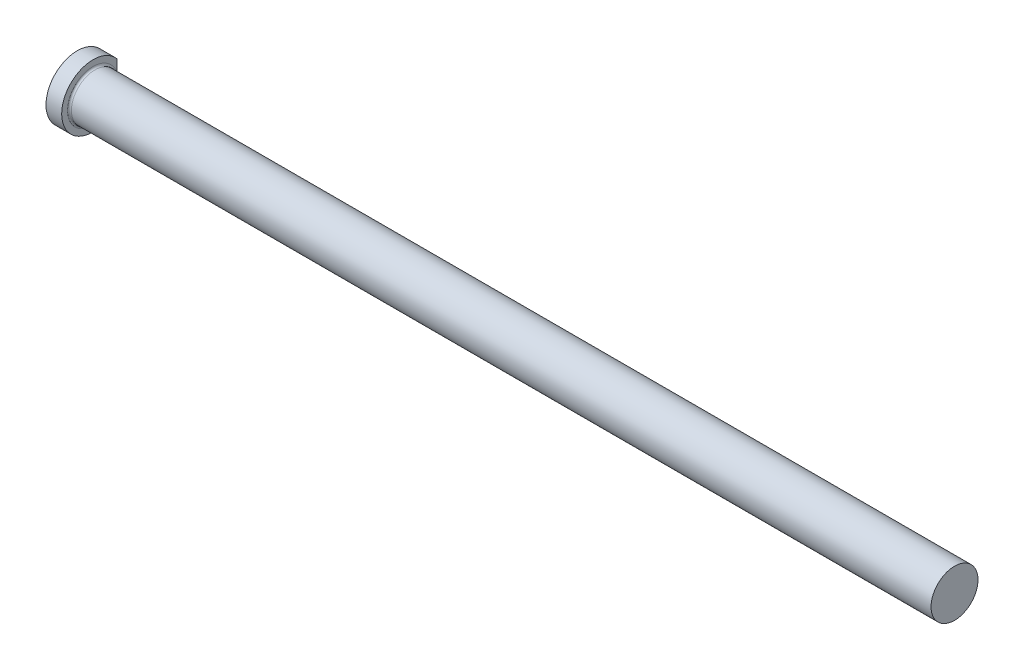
ISO-10303-21;
HEADER;
FILE_DESCRIPTION(('STEP AP214'),'2;1');
FILE_NAME('part.step','',(''),(''),'','','');
FILE_SCHEMA(('AUTOMOTIVE_DESIGN { 1 0 10303 214 1 1 1 1 }'));
ENDSEC;
DATA;
#1=APPLICATION_CONTEXT('core data for automotive mechanical design processes');
#2=APPLICATION_PROTOCOL_DEFINITION('international standard','automotive_design',2000,#1);
#3=PRODUCT_CONTEXT('',#1,'mechanical');
#4=PRODUCT('Part','Part','',(#3));
#5=PRODUCT_RELATED_PRODUCT_CATEGORY('part','',(#4));
#6=PRODUCT_DEFINITION_FORMATION('','',#4);
#7=PRODUCT_DEFINITION_CONTEXT('part definition',#1,'design');
#8=PRODUCT_DEFINITION('design','',#6,#7);
#9=PRODUCT_DEFINITION_SHAPE('','',#8);
#10=(LENGTH_UNIT() NAMED_UNIT(*) SI_UNIT(.MILLI.,.METRE.));
#11=(NAMED_UNIT(*) PLANE_ANGLE_UNIT() SI_UNIT($,.RADIAN.));
#12=(NAMED_UNIT(*) SI_UNIT($,.STERADIAN.) SOLID_ANGLE_UNIT());
#13=UNCERTAINTY_MEASURE_WITH_UNIT(LENGTH_MEASURE(1.E-05),#10,'distance_accuracy_value','');
#14=(GEOMETRIC_REPRESENTATION_CONTEXT(3) GLOBAL_UNCERTAINTY_ASSIGNED_CONTEXT((#13)) GLOBAL_UNIT_ASSIGNED_CONTEXT((#10,
#11,#12)) REPRESENTATION_CONTEXT('',''));
#15=CARTESIAN_POINT('',(0.,0.,0.));
#16=DIRECTION('',(0.,0.,1.));
#17=DIRECTION('',(1.,0.,0.));
#18=AXIS2_PLACEMENT_3D('',#15,#16,#17);
#19=CARTESIAN_POINT('',(0.,0.,0.));
#20=DIRECTION('',(1.,0.,0.));
#21=DIRECTION('',(0.,1.,0.));
#22=AXIS2_PLACEMENT_3D('',#19,#20,#21);
#23=PLANE('',#22);
#24=DIRECTION('',(0.,1.,0.));
#25=VECTOR('',#24,1.);
#26=CARTESIAN_POINT('',(0.,0.,-9.69644999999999));
#27=LINE('',#26,#25);
#28=CARTESIAN_POINT('',(0.,-8.20175940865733,-9.69644999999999));
#29=VERTEX_POINT('',#28);
#30=CARTESIAN_POINT('',(0.,8.20175940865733,-9.69644999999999));
#31=VERTEX_POINT('',#30);
#32=EDGE_CURVE('E49',#29,#31,#27,.T.);
#33=ORIENTED_EDGE('',*,*,#32,.F.);
#34=CARTESIAN_POINT('',(0.,0.,0.));
#35=DIRECTION('',(-1.,0.,0.));
#36=DIRECTION('',(0.,-1.,0.));
#37=AXIS2_PLACEMENT_3D('',#34,#35,#36);
#38=CIRCLE('',#37,12.7);
#39=EDGE_CURVE('E43',#29,#31,#38,.T.);
#40=ORIENTED_EDGE('',*,*,#39,.T.);
#41=EDGE_LOOP('',(#33,#40));
#42=FACE_BOUND('',#41,.T.);
#43=ADVANCED_FACE('F32',(#42),#23,.F.);
#44=CARTESIAN_POINT('',(355.6,0.,0.));
#45=DIRECTION('',(-1.,0.,0.));
#46=DIRECTION('',(0.,-1.,0.));
#47=AXIS2_PLACEMENT_3D('',#44,#45,#46);
#48=CYLINDRICAL_SURFACE('',#47,12.7);
#49=DIRECTION('',(-1.,0.,0.));
#50=VECTOR('',#49,1.);
#51=CARTESIAN_POINT('',(355.6,-8.20175940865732,-9.69645));
#52=LINE('',#51,#50);
#53=CARTESIAN_POINT('',(6.35000000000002,-8.20175940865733,-9.69645));
#54=VERTEX_POINT('',#53);
#55=EDGE_CURVE('E87',#54,#29,#52,.T.);
#56=ORIENTED_EDGE('',*,*,#55,.F.);
#57=CARTESIAN_POINT('',(6.35000000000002,0.,0.));
#58=DIRECTION('',(-1.,0.,0.));
#59=DIRECTION('',(0.,-1.,0.));
#60=AXIS2_PLACEMENT_3D('',#57,#58,#59);
#61=CIRCLE('',#60,12.7);
#62=CARTESIAN_POINT('',(6.35000000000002,8.20175940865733,-9.69644999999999));
#63=VERTEX_POINT('',#62);
#64=EDGE_CURVE('E75',#54,#63,#61,.T.);
#65=ORIENTED_EDGE('',*,*,#64,.T.);
#66=DIRECTION('',(-1.,0.,0.));
#67=VECTOR('',#66,1.);
#68=CARTESIAN_POINT('',(355.6,8.20175940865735,-9.69644999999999));
#69=LINE('',#68,#67);
#70=EDGE_CURVE('E56',#31,#63,#69,.F.);
#71=ORIENTED_EDGE('',*,*,#70,.F.);
#72=ORIENTED_EDGE('',*,*,#39,.F.);
#73=EDGE_LOOP('',(#56,#65,#71,#72));
#74=FACE_BOUND('',#73,.T.);
#75=ADVANCED_FACE('F97',(#74),#48,.T.);
#76=CARTESIAN_POINT('',(6.35,12.7,0.));
#77=DIRECTION('',(-1.,0.,0.));
#78=DIRECTION('',(0.,-1.,0.));
#79=AXIS2_PLACEMENT_3D('',#76,#77,#78);
#80=PLANE('',#79);
#81=DIRECTION('',(0.,-1.,0.));
#82=VECTOR('',#81,1.);
#83=CARTESIAN_POINT('',(6.35,12.7,-9.69644999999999));
#84=LINE('',#83,#82);
#85=CARTESIAN_POINT('',(6.35000000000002,3.49192267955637,-9.69644999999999));
#86=VERTEX_POINT('',#85);
#87=EDGE_CURVE('E84',#63,#86,#84,.T.);
#88=ORIENTED_EDGE('',*,*,#87,.F.);
#89=ORIENTED_EDGE('',*,*,#64,.F.);
#90=CARTESIAN_POINT('',(6.34999999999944,-3.49192267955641,-9.69644999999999));
#91=VERTEX_POINT('',#90);
#92=EDGE_CURVE('E80',#91,#54,#84,.T.);
#93=ORIENTED_EDGE('',*,*,#92,.F.);
#94=CARTESIAN_POINT('',(6.35000000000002,0.,0.));
#95=DIRECTION('',(-1.,0.,0.));
#96=DIRECTION('',(0.,-1.,0.));
#97=AXIS2_PLACEMENT_3D('',#94,#95,#96);
#98=CIRCLE('',#97,10.30605);
#99=EDGE_CURVE('E70',#91,#86,#98,.T.);
#100=ORIENTED_EDGE('',*,*,#99,.T.);
#101=EDGE_LOOP('',(#88,#89,#93,#100));
#102=FACE_BOUND('',#101,.T.);
#103=ADVANCED_FACE('F81',(#102),#80,.F.);
#104=CARTESIAN_POINT('',(7.1374,0.,0.));
#105=DIRECTION('',(-1.,0.,0.));
#106=DIRECTION('',(0.,-1.,0.));
#107=AXIS2_PLACEMENT_3D('',#104,#105,#106);
#108=TOROIDAL_SURFACE('',#107,10.30605,0.7874);
#109=CARTESIAN_POINT('',(7.13740000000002,0.,0.));
#110=DIRECTION('',(-1.,0.,0.));
#111=DIRECTION('',(0.,-1.,0.));
#112=AXIS2_PLACEMENT_3D('',#109,#110,#111);
#113=CIRCLE('',#112,9.51865);
#114=CARTESIAN_POINT('',(7.13740000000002,-9.51865,0.));
#115=VERTEX_POINT('',#114);
#116=EDGE_CURVE('E76',#115,#115,#113,.T.);
#117=ORIENTED_EDGE('',*,*,#116,.T.);
#118=EDGE_LOOP('',(#117));
#119=FACE_BOUND('',#118,.T.);
#120=CARTESIAN_POINT('',(6.63901601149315,0.,-9.69644999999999));
#121=CARTESIAN_POINT('',(6.63901576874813,-0.131334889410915,-9.69644999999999));
#122=CARTESIAN_POINT('',(6.63569367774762,-0.262669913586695,-9.69644999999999));
#123=CARTESIAN_POINT('',(6.62309169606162,-0.525061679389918,-9.69644999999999));
#124=CARTESIAN_POINT('',(6.61381056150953,-0.656118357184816,-9.69644999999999));
#125=CARTESIAN_POINT('',(6.59089030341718,-0.918594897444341,-9.69644999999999));
#126=CARTESIAN_POINT('',(6.57722622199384,-1.05001245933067,-9.69644999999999));
#127=CARTESIAN_POINT('',(6.54752507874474,-1.31256416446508,-9.69644999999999));
#128=CARTESIAN_POINT('',(6.5314880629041,-1.44369831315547,-9.69644999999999));
#129=CARTESIAN_POINT('',(6.49099253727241,-1.76947250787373,-9.69644999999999));
#130=CARTESIAN_POINT('',(6.46622117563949,-1.96407343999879,-9.69644999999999));
#131=CARTESIAN_POINT('',(6.42077096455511,-2.35389547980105,-9.69644999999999));
#132=CARTESIAN_POINT('',(6.40009460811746,-2.54911689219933,-9.69644999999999));
#133=CARTESIAN_POINT('',(6.36779284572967,-2.9397438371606,-9.69644999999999));
#134=CARTESIAN_POINT('',(6.35613645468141,-3.13514640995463,-9.69644999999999));
#135=CARTESIAN_POINT('',(6.34966327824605,-3.42840089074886,-9.69644999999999));
#136=CARTESIAN_POINT('',(6.34933787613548,-3.52612238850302,-9.69644999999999));
#137=CARTESIAN_POINT('',(6.35328475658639,-3.72146247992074,-9.69644999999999));
#138=CARTESIAN_POINT('',(6.35755549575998,-3.81908109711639,-9.69644999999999));
#139=CARTESIAN_POINT('',(6.36978515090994,-3.98560714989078,-9.69644999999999));
#140=CARTESIAN_POINT('',(6.37631253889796,-4.05461846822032,-9.69644999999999));
#141=CARTESIAN_POINT('',(6.39282059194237,-4.19226800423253,-9.69644999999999));
#142=CARTESIAN_POINT('',(6.40280265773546,-4.26090605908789,-9.69644999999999));
#143=CARTESIAN_POINT('',(6.42687360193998,-4.3972333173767,-9.69644999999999));
#144=CARTESIAN_POINT('',(6.44094853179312,-4.46492493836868,-9.69644999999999));
#145=CARTESIAN_POINT('',(6.47412512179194,-4.59904233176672,-9.69644999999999));
#146=CARTESIAN_POINT('',(6.49322213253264,-4.66546921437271,-9.69645));
#147=CARTESIAN_POINT('',(6.53101824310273,-4.77646480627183,-9.69645));
#148=CARTESIAN_POINT('',(6.54809873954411,-4.821581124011,-9.69645));
#149=CARTESIAN_POINT('',(6.5859792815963,-4.91032685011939,-9.69645));
#150=CARTESIAN_POINT('',(6.60678419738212,-4.95395422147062,-9.69645));
#151=CARTESIAN_POINT('',(6.65305798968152,-5.03914305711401,-9.69645));
#152=CARTESIAN_POINT('',(6.67856206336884,-5.08068569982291,-9.69645));
#153=CARTESIAN_POINT('',(6.73513723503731,-5.1598033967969,-9.69645));
#154=CARTESIAN_POINT('',(6.76619307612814,-5.1973888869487,-9.69645));
#155=CARTESIAN_POINT('',(6.82043462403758,-5.25143793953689,-9.69645));
#156=CARTESIAN_POINT('',(6.84140095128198,-5.27011577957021,-9.69645));
#157=CARTESIAN_POINT('',(6.88572156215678,-5.30445571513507,-9.69645));
#158=CARTESIAN_POINT('',(6.90907597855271,-5.32011764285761,-9.69645));
#159=CARTESIAN_POINT('',(6.95842982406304,-5.34755452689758,-9.69645));
#160=CARTESIAN_POINT('',(6.98446038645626,-5.35927483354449,-9.69645));
#161=CARTESIAN_POINT('',(7.03833196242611,-5.37729012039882,-9.69645));
#162=CARTESIAN_POINT('',(7.0661686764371,-5.38359751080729,-9.69645));
#163=CARTESIAN_POINT('',(7.11861133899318,-5.3895133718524,-9.69645));
#164=CARTESIAN_POINT('',(7.14312612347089,-5.38993375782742,-9.69645));
#165=CARTESIAN_POINT('',(7.19179040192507,-5.38610574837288,-9.69645));
#166=CARTESIAN_POINT('',(7.21593980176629,-5.38185616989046,-9.69645));
#167=CARTESIAN_POINT('',(7.26056342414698,-5.36982537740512,-9.69645));
#168=CARTESIAN_POINT('',(7.28115547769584,-5.36246747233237,-9.69645));
#169=CARTESIAN_POINT('',(7.32107376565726,-5.34491360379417,-9.69645));
#170=CARTESIAN_POINT('',(7.34039977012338,-5.33471712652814,-9.69645));
#171=CARTESIAN_POINT('',(7.38913644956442,-5.30501388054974,-9.69645));
#172=CARTESIAN_POINT('',(7.41741023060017,-5.28364480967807,-9.69645));
#173=CARTESIAN_POINT('',(7.47031071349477,-5.23678376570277,-9.69645));
#174=CARTESIAN_POINT('',(7.49492590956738,-5.21127929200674,-9.69645));
#175=CARTESIAN_POINT('',(7.5572725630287,-5.13831274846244,-9.69645));
#176=CARTESIAN_POINT('',(7.59183361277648,-5.08816630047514,-9.69645));
#177=CARTESIAN_POINT('',(7.65346183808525,-4.98353200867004,-9.69645));
#178=CARTESIAN_POINT('',(7.68050999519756,-4.92903358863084,-9.69645));
#179=CARTESIAN_POINT('',(7.72936538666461,-4.81602696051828,-9.69645));
#180=CARTESIAN_POINT('',(7.75101131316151,-4.75745020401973,-9.69644999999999));
#181=CARTESIAN_POINT('',(7.78936243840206,-4.63867498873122,-9.69644999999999));
#182=CARTESIAN_POINT('',(7.80606234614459,-4.57847486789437,-9.69644999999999));
#183=CARTESIAN_POINT('',(7.83542349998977,-4.45703685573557,-9.69644999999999));
#184=CARTESIAN_POINT('',(7.84807976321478,-4.39579778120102,-9.69644999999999));
#185=CARTESIAN_POINT('',(7.87000608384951,-4.27270556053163,-9.69644999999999));
#186=CARTESIAN_POINT('',(7.87927487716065,-4.21085219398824,-9.69644999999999));
#187=CARTESIAN_POINT('',(7.89601954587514,-4.07827166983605,-9.69644999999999));
#188=CARTESIAN_POINT('',(7.90307454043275,-4.00749212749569,-9.69644999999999));
#189=CARTESIAN_POINT('',(7.91407245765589,-3.865686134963,-9.69644999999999));
#190=CARTESIAN_POINT('',(7.91801466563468,-3.79465963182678,-9.69644999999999));
#191=CARTESIAN_POINT('',(7.92591154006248,-3.5813131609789,-9.69644999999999));
#192=CARTESIAN_POINT('',(7.92592303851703,-3.43884695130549,-9.69644999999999));
#193=CARTESIAN_POINT('',(7.91836277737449,-3.15372342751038,-9.69644999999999));
#194=CARTESIAN_POINT('',(7.91076657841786,-3.01106697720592,-9.69644999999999));
#195=CARTESIAN_POINT('',(7.89020648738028,-2.7262486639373,-9.69644999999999));
#196=CARTESIAN_POINT('',(7.87724592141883,-2.58408654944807,-9.69644999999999));
#197=CARTESIAN_POINT('',(7.84058594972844,-2.22939512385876,-9.69644999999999));
#198=CARTESIAN_POINT('',(7.81475345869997,-2.01709889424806,-9.69644999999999));
#199=CARTESIAN_POINT('',(7.77510364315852,-1.69870824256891,-9.69644999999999));
#200=CARTESIAN_POINT('',(7.76173202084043,-1.59254983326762,-9.69644999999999));
#201=CARTESIAN_POINT('',(7.73559724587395,-1.38015912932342,-9.69644999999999));
#202=CARTESIAN_POINT('',(7.72283410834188,-1.27392683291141,-9.69644999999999));
#203=CARTESIAN_POINT('',(7.68714717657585,-0.956499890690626,-9.69644999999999));
#204=CARTESIAN_POINT('',(7.66659886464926,-0.744990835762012,-9.69644999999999));
#205=CARTESIAN_POINT('',(7.64646504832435,-0.427145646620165,-9.69644999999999));
#206=CARTESIAN_POINT('',(7.64153497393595,-0.321164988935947,-9.69644999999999));
#207=CARTESIAN_POINT('',(7.63584195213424,-0.109092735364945,-9.69644999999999));
#208=CARTESIAN_POINT('',(7.63507878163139,-0.00300114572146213,-9.69644999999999));
#209=CARTESIAN_POINT('',(7.63776398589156,0.204220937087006,-9.69644999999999));
#210=CARTESIAN_POINT('',(7.64101933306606,0.305354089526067,-9.69644999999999));
#211=CARTESIAN_POINT('',(7.65101817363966,0.507448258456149,-9.69644999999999));
#212=CARTESIAN_POINT('',(7.65776187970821,0.608409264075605,-9.69644999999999));
#213=CARTESIAN_POINT('',(7.68215757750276,0.911188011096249,-9.69644999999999));
#214=CARTESIAN_POINT('',(7.70396781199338,1.11265414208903,-9.69644999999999));
#215=CARTESIAN_POINT('',(7.75179507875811,1.51651999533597,-9.69644999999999));
#216=CARTESIAN_POINT('',(7.77784191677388,1.71891566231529,-9.69644999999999));
#217=CARTESIAN_POINT('',(7.82767572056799,2.12388033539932,-9.69644999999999));
#218=CARTESIAN_POINT('',(7.85146425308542,2.32644912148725,-9.69644999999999));
#219=CARTESIAN_POINT('',(7.88316262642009,2.64971578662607,-9.69644999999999));
#220=CARTESIAN_POINT('',(7.8935935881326,2.77015696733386,-9.69644999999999));
#221=CARTESIAN_POINT('',(7.91052719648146,3.01137425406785,-9.69644999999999));
#222=CARTESIAN_POINT('',(7.91702838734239,3.13215046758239,-9.69644999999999));
#223=CARTESIAN_POINT('',(7.92471071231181,3.37325531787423,-9.69644999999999));
#224=CARTESIAN_POINT('',(7.92591957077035,3.49358297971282,-9.69644999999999));
#225=CARTESIAN_POINT('',(7.92144474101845,3.73408481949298,-9.69644999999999));
#226=CARTESIAN_POINT('',(7.91576535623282,3.85425904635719,-9.69644999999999));
#227=CARTESIAN_POINT('',(7.8980828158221,4.06100539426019,-9.69644999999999));
#228=CARTESIAN_POINT('',(7.88823990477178,4.14775837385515,-9.69644999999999));
#229=CARTESIAN_POINT('',(7.86247955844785,4.32085682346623,-9.69644999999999));
#230=CARTESIAN_POINT('',(7.84653179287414,4.40719804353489,-9.69644999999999));
#231=CARTESIAN_POINT('',(7.81386532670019,4.54789086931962,-9.69644999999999));
#232=CARTESIAN_POINT('',(7.79941037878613,4.60276536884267,-9.69644999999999));
#233=CARTESIAN_POINT('',(7.76656944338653,4.71141379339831,-9.69644999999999));
#234=CARTESIAN_POINT('',(7.74817939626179,4.76518651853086,-9.69644999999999));
#235=CARTESIAN_POINT('',(7.70674591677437,4.870547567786,-9.69644999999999));
#236=CARTESIAN_POINT('',(7.68373253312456,4.92214752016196,-9.69644999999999));
#237=CARTESIAN_POINT('',(7.63185783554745,5.02226478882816,-9.69644999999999));
#238=CARTESIAN_POINT('',(7.60301235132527,5.0707899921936,-9.69644999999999));
#239=CARTESIAN_POINT('',(7.5466488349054,5.15031473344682,-9.69644999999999));
#240=CARTESIAN_POINT('',(7.52085437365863,5.18252134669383,-9.69644999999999));
#241=CARTESIAN_POINT('',(7.46461013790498,5.24257489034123,-9.69644999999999));
#242=CARTESIAN_POINT('',(7.43417576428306,5.27043564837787,-9.69644999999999));
#243=CARTESIAN_POINT('',(7.38060873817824,5.31017367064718,-9.69644999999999));
#244=CARTESIAN_POINT('',(7.35902426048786,5.32412477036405,-9.69644999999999));
#245=CARTESIAN_POINT('',(7.31394468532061,5.34855487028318,-9.69644999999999));
#246=CARTESIAN_POINT('',(7.29045059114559,5.35903567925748,-9.69644999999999));
#247=CARTESIAN_POINT('',(7.2416697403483,5.37573176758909,-9.69644999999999));
#248=CARTESIAN_POINT('',(7.21636627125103,5.38189943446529,-9.69644999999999));
#249=CARTESIAN_POINT('',(7.16504271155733,5.38906457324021,-9.69644999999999));
#250=CARTESIAN_POINT('',(7.13902350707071,5.39006817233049,-9.69644999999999));
#251=CARTESIAN_POINT('',(7.09098675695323,5.38703115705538,-9.69644999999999));
#252=CARTESIAN_POINT('',(7.06892190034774,5.38368130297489,-9.69644999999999));
#253=CARTESIAN_POINT('',(7.02564528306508,5.37340491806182,-9.69644999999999));
#254=CARTESIAN_POINT('',(7.00443403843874,5.36647625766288,-9.69644999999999));
#255=CARTESIAN_POINT('',(6.95695041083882,5.34695692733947,-9.69644999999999));
#256=CARTESIAN_POINT('',(6.93112740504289,5.33328033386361,-9.69644999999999));
#257=CARTESIAN_POINT('',(6.88201240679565,5.30197123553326,-9.69644999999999));
#258=CARTESIAN_POINT('',(6.85872573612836,5.28433064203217,-9.69644999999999));
#259=CARTESIAN_POINT('',(6.80225762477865,5.23543941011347,-9.69644999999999));
#260=CARTESIAN_POINT('',(6.77088547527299,5.202117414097,-9.69644999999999));
#261=CARTESIAN_POINT('',(6.71343360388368,5.13122512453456,-9.69644999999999));
#262=CARTESIAN_POINT('',(6.68736700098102,5.09364464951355,-9.69644999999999));
#263=CARTESIAN_POINT('',(6.6409585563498,5.0179757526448,-9.69644999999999));
#264=CARTESIAN_POINT('',(6.62038014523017,4.98002985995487,-9.69644999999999));
#265=CARTESIAN_POINT('',(6.58250086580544,4.90251759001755,-9.69644999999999));
#266=CARTESIAN_POINT('',(6.56520303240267,4.86294975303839,-9.69644999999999));
#267=CARTESIAN_POINT('',(6.53336451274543,4.78264447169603,-9.69644999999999));
#268=CARTESIAN_POINT('',(6.51882922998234,4.74190491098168,-9.69644999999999));
#269=CARTESIAN_POINT('',(6.4921615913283,4.65967321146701,-9.69644999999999));
#270=CARTESIAN_POINT('',(6.48002834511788,4.61818135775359,-9.69644999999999));
#271=CARTESIAN_POINT('',(6.45341019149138,4.51800273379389,-9.69644999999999));
#272=CARTESIAN_POINT('',(6.43991528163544,4.45905354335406,-9.69644999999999));
#273=CARTESIAN_POINT('',(6.41629981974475,4.34047511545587,-9.69644999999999));
#274=CARTESIAN_POINT('',(6.4061807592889,4.28084558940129,-9.69644999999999));
#275=CARTESIAN_POINT('',(6.38006447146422,4.10115364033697,-9.69644999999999));
#276=CARTESIAN_POINT('',(6.36835181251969,3.9804669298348,-9.69644999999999));
#277=CARTESIAN_POINT('',(6.35332662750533,3.7381279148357,-9.69644999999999));
#278=CARTESIAN_POINT('',(6.35005130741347,3.61647369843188,-9.69644999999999));
#279=CARTESIAN_POINT('',(6.34994990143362,3.37312773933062,-9.69644999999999));
#280=CARTESIAN_POINT('',(6.35312684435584,3.25143600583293,-9.69644999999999));
#281=CARTESIAN_POINT('',(6.36479593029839,2.99859961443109,-9.69644999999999));
#282=CARTESIAN_POINT('',(6.37369186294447,2.86747527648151,-9.69644999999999));
#283=CARTESIAN_POINT('',(6.39550909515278,2.60555532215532,-9.69644999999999));
#284=CARTESIAN_POINT('',(6.40843109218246,2.47475976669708,-9.69644999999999));
#285=CARTESIAN_POINT('',(6.43682885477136,2.21322922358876,-9.69644999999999));
#286=CARTESIAN_POINT('',(6.45230895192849,2.08249472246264,-9.69644999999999));
#287=CARTESIAN_POINT('',(6.48430402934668,1.82116462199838,-9.69644999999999));
#288=CARTESIAN_POINT('',(6.50081894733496,1.69056901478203,-9.69644999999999));
#289=CARTESIAN_POINT('',(6.53313088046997,1.43032183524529,-9.69644999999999));
#290=CARTESIAN_POINT('',(6.54893249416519,1.3006708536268,-9.69644999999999));
#291=CARTESIAN_POINT('',(6.57816848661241,1.04109047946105,-9.69644999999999));
#292=CARTESIAN_POINT('',(6.59160286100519,0.911161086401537,-9.69644999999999));
#293=CARTESIAN_POINT('',(6.61417743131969,0.651162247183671,-9.69644999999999));
#294=CARTESIAN_POINT('',(6.62332587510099,0.521093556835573,-9.69644999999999));
#295=CARTESIAN_POINT('',(6.63574469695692,0.260683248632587,-9.69644999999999));
#296=CARTESIAN_POINT('',(6.63901625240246,0.130341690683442,-9.69644999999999));
#297=CARTESIAN_POINT('',(6.63901601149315,0.,-9.69644999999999));
#298=B_SPLINE_CURVE_WITH_KNOTS('',3,(#120,#121,#122,#123,#124,#125,#126,#127,#128,#129,#130,
#131,#132,#133,#134,#135,#136,#137,#138,#139,#140,#141,#142,#143,#144,#145,#146,#147,#148,#149,
#150,#151,#152,#153,#154,#155,#156,#157,#158,#159,#160,#161,#162,#163,#164,#165,#166,#167,#168,
#169,#170,#171,#172,#173,#174,#175,#176,#177,#178,#179,#180,#181,#182,#183,#184,#185,#186,#187,
#188,#189,#190,#191,#192,#193,#194,#195,#196,#197,#198,#199,#200,#201,#202,#203,#204,#205,#206,
#207,#208,#209,#210,#211,#212,#213,#214,#215,#216,#217,#218,#219,#220,#221,#222,#223,#224,#225,
#226,#227,#228,#229,#230,#231,#232,#233,#234,#235,#236,#237,#238,#239,#240,#241,#242,#243,#244,
#245,#246,#247,#248,#249,#250,#251,#252,#253,#254,#255,#256,#257,#258,#259,#260,#261,#262,#263,
#264,#265,#266,#267,#268,#269,#270,#271,#272,#273,#274,#275,#276,#277,#278,#279,#280,#281,#282,
#283,#284,#285,#286,#287,#288,#289,#290,#291,#292,#293,#294,#295,#296,#297),.UNSPECIFIED.,.T.,
.F.,(4,2,2,2,2,2,2,2,2,2,2,2,2,2,2,2,2,2,2,2,2,2,2,2,2,2,2,2,2,2,2,2,2,2,2,2,2,2,2,2,2,2,2,2,2,
2,2,2,2,2,2,2,2,2,2,2,2,2,2,2,2,2,2,2,2,2,2,2,2,2,2,2,2,2,2,2,2,2,2,2,2,2,2,2,2,2,2,2,4),(0.,
0.39396963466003,0.788021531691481,1.18435835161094,1.58068749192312,2.16919546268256,
2.7580606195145,3.34489383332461,3.63798037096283,3.93096852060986,4.138857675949,
4.34683122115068,4.55410413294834,4.76118582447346,4.90578374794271,5.05057215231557,
5.19649271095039,5.34201826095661,5.42605253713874,5.51009148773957,5.59525171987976,
5.68021617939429,5.75332535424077,5.82645305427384,5.89180930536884,5.95717739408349,
6.06288679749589,6.16892191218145,6.35060200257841,6.53273789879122,6.71979376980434,
6.90704902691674,7.09453415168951,7.28208916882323,7.49539481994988,7.70874943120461,
8.13582202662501,8.56427098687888,8.99245468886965,9.63398906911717,9.95498100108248,
10.275980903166,10.9131788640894,11.2313907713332,11.5495856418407,11.8530735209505,
12.1565799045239,12.7643336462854,13.3765643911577,13.9883672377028,14.3509981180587,
14.7137632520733,15.0746257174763,15.4352628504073,15.6970416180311,15.9601382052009,
16.1302660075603,16.3005701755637,16.4698013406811,16.6385791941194,16.7620347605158,
16.8850891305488,16.9619467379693,17.0387642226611,17.1164168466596,17.1939773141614,
17.2606102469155,17.3272828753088,17.4144575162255,17.5018116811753,17.6383403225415,
17.7752025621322,17.9045105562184,18.0339375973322,18.1636152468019,18.2932447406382,
18.4745377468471,18.6559107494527,19.0192072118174,19.384102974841,19.7491700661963,
20.1433594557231,20.5376171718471,20.9325494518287,21.3274579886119,21.7192830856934,
22.1111089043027,22.5021775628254,22.8931678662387),.UNSPECIFIED.);
#299=EDGE_CURVE('E12',#86,#91,#298,.T.);
#300=ORIENTED_EDGE('',*,*,#299,.F.);
#301=ORIENTED_EDGE('',*,*,#99,.F.);
#302=EDGE_LOOP('',(#300,#301));
#303=FACE_BOUND('',#302,.T.);
#304=ADVANCED_FACE('F72',(#119,#303),#108,.F.);
#305=CARTESIAN_POINT('',(355.6,0.,0.));
#306=DIRECTION('',(-1.,0.,0.));
#307=DIRECTION('',(0.,-1.,0.));
#308=AXIS2_PLACEMENT_3D('',#305,#306,#307);
#309=CYLINDRICAL_SURFACE('',#308,9.51864999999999);
#310=ORIENTED_EDGE('',*,*,#116,.F.);
#311=EDGE_LOOP('',(#310));
#312=FACE_BOUND('',#311,.T.);
#313=CARTESIAN_POINT('',(355.6,0.,0.));
#314=DIRECTION('',(-1.,0.,0.));
#315=DIRECTION('',(0.,-1.,0.));
#316=AXIS2_PLACEMENT_3D('',#313,#314,#315);
#317=CIRCLE('',#316,9.51864999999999);
#318=CARTESIAN_POINT('',(355.6,-9.51864999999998,0.));
#319=VERTEX_POINT('',#318);
#320=EDGE_CURVE('E92',#319,#319,#317,.T.);
#321=ORIENTED_EDGE('',*,*,#320,.T.);
#322=EDGE_LOOP('',(#321));
#323=FACE_BOUND('',#322,.T.);
#324=ADVANCED_FACE('F107',(#312,#323),#309,.T.);
#325=CARTESIAN_POINT('',(355.6,9.51865,0.));
#326=DIRECTION('',(-1.,0.,0.));
#327=DIRECTION('',(0.,-1.,0.));
#328=AXIS2_PLACEMENT_3D('',#325,#326,#327);
#329=PLANE('',#328);
#330=ORIENTED_EDGE('',*,*,#320,.F.);
#331=EDGE_LOOP('',(#330));
#332=FACE_BOUND('',#331,.T.);
#333=ADVANCED_FACE('F111',(#332),#329,.F.);
#334=CARTESIAN_POINT('',(0.,0.,-9.69644999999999));
#335=DIRECTION('',(0.,0.,-1.));
#336=DIRECTION('',(0.,1.,0.));
#337=AXIS2_PLACEMENT_3D('',#334,#335,#336);
#338=PLANE('',#337);
#339=ORIENTED_EDGE('',*,*,#55,.T.);
#340=ORIENTED_EDGE('',*,*,#32,.T.);
#341=ORIENTED_EDGE('',*,*,#70,.T.);
#342=ORIENTED_EDGE('',*,*,#87,.T.);
#343=ORIENTED_EDGE('',*,*,#299,.T.);
#344=ORIENTED_EDGE('',*,*,#92,.T.);
#345=EDGE_LOOP('',(#339,#340,#341,#342,#343,#344));
#346=FACE_BOUND('',#345,.T.);
#347=ADVANCED_FACE('F86',(#346),#338,.T.);
#348=CLOSED_SHELL('',(#43,#75,#103,#304,#324,#333,#347));
#349=MANIFOLD_SOLID_BREP('B2',#348);
#350=ADVANCED_BREP_SHAPE_REPRESENTATION('',(#18,#349),#14);
#351=SHAPE_DEFINITION_REPRESENTATION(#9,#350);
ENDSEC;
END-ISO-10303-21;
